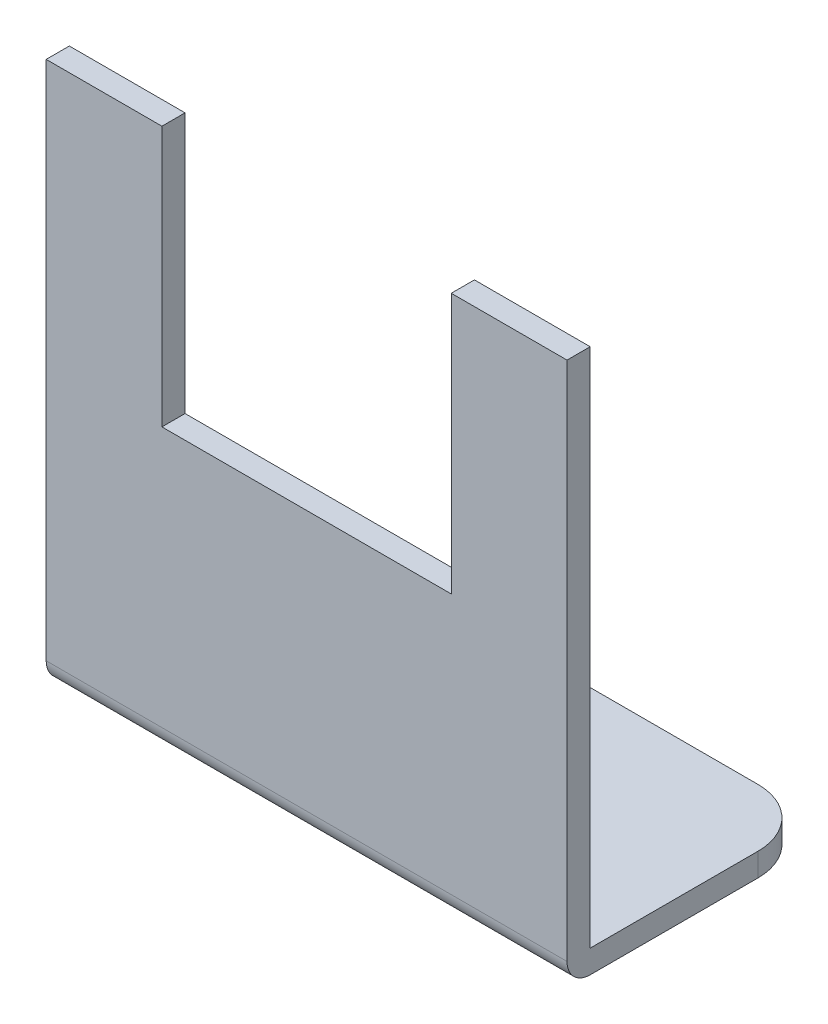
ISO-10303-21;
HEADER;
FILE_DESCRIPTION(('STEP AP214'),'2;1');
FILE_NAME('part.step','',(''),(''),'','','');
FILE_SCHEMA(('AUTOMOTIVE_DESIGN { 1 0 10303 214 1 1 1 1 }'));
ENDSEC;
DATA;
#1=APPLICATION_CONTEXT('core data for automotive mechanical design processes');
#2=APPLICATION_PROTOCOL_DEFINITION('international standard','automotive_design',2000,#1);
#3=PRODUCT_CONTEXT('',#1,'mechanical');
#4=PRODUCT('Part','Part','',(#3));
#5=PRODUCT_RELATED_PRODUCT_CATEGORY('part','',(#4));
#6=PRODUCT_DEFINITION_FORMATION('','',#4);
#7=PRODUCT_DEFINITION_CONTEXT('part definition',#1,'design');
#8=PRODUCT_DEFINITION('design','',#6,#7);
#9=PRODUCT_DEFINITION_SHAPE('','',#8);
#10=(LENGTH_UNIT() NAMED_UNIT(*) SI_UNIT(.MILLI.,.METRE.));
#11=(NAMED_UNIT(*) PLANE_ANGLE_UNIT() SI_UNIT($,.RADIAN.));
#12=(NAMED_UNIT(*) SI_UNIT($,.STERADIAN.) SOLID_ANGLE_UNIT());
#13=UNCERTAINTY_MEASURE_WITH_UNIT(LENGTH_MEASURE(1.E-05),#10,'distance_accuracy_value','');
#14=(GEOMETRIC_REPRESENTATION_CONTEXT(3) GLOBAL_UNCERTAINTY_ASSIGNED_CONTEXT((#13)) GLOBAL_UNIT_ASSIGNED_CONTEXT((#10,
#11,#12)) REPRESENTATION_CONTEXT('',''));
#15=CARTESIAN_POINT('',(0.,0.,0.));
#16=DIRECTION('',(0.,0.,1.));
#17=DIRECTION('',(1.,0.,0.));
#18=AXIS2_PLACEMENT_3D('',#15,#16,#17);
#19=CARTESIAN_POINT('',(0.,0.,0.));
#20=DIRECTION('',(0.,0.,1.));
#21=DIRECTION('',(1.,0.,0.));
#22=AXIS2_PLACEMENT_3D('',#19,#20,#21);
#23=PLANE('',#22);
#24=DIRECTION('',(0.,-1.,0.));
#25=VECTOR('',#24,1.);
#26=CARTESIAN_POINT('',(12.5,0.,0.));
#27=LINE('',#26,#25);
#28=CARTESIAN_POINT('',(12.5,23.5,0.));
#29=VERTEX_POINT('',#28);
#30=CARTESIAN_POINT('',(12.5,0.999999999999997,0.));
#31=VERTEX_POINT('',#30);
#32=EDGE_CURVE('E247',#29,#31,#27,.T.);
#33=ORIENTED_EDGE('',*,*,#32,.F.);
#34=DIRECTION('',(1.,0.,0.));
#35=VECTOR('',#34,1.);
#36=CARTESIAN_POINT('',(-22.5,23.5,0.));
#37=LINE('',#36,#35);
#38=CARTESIAN_POINT('',(22.5,23.5,0.));
#39=VERTEX_POINT('',#38);
#40=EDGE_CURVE('E149',#29,#39,#37,.T.);
#41=ORIENTED_EDGE('',*,*,#40,.T.);
#42=DIRECTION('',(0.,-1.,0.));
#43=VECTOR('',#42,1.);
#44=CARTESIAN_POINT('',(22.5,23.5,0.));
#45=LINE('',#44,#43);
#46=CARTESIAN_POINT('',(22.5,-21.5,0.));
#47=VERTEX_POINT('',#46);
#48=EDGE_CURVE('E168',#39,#47,#45,.T.);
#49=ORIENTED_EDGE('',*,*,#48,.T.);
#50=DIRECTION('',(1.,0.,0.));
#51=VECTOR('',#50,1.);
#52=CARTESIAN_POINT('',(22.5,-21.5,0.));
#53=LINE('',#52,#51);
#54=CARTESIAN_POINT('',(-22.5,-21.5,0.));
#55=VERTEX_POINT('',#54);
#56=EDGE_CURVE('E217',#55,#47,#53,.T.);
#57=ORIENTED_EDGE('',*,*,#56,.F.);
#58=DIRECTION('',(0.,-1.,0.));
#59=VECTOR('',#58,1.);
#60=CARTESIAN_POINT('',(-22.5,23.5,0.));
#61=LINE('',#60,#59);
#62=CARTESIAN_POINT('',(-22.5,23.5,0.));
#63=VERTEX_POINT('',#62);
#64=EDGE_CURVE('E165',#63,#55,#61,.T.);
#65=ORIENTED_EDGE('',*,*,#64,.F.);
#66=CARTESIAN_POINT('',(-12.5,23.5,0.));
#67=VERTEX_POINT('',#66);
#68=EDGE_CURVE('E172',#63,#67,#37,.T.);
#69=ORIENTED_EDGE('',*,*,#68,.T.);
#70=DIRECTION('',(0.,-1.,0.));
#71=VECTOR('',#70,1.);
#72=CARTESIAN_POINT('',(-12.5,0.,0.));
#73=LINE('',#72,#71);
#74=CARTESIAN_POINT('',(-12.5,1.,0.));
#75=VERTEX_POINT('',#74);
#76=EDGE_CURVE('E150',#67,#75,#73,.T.);
#77=ORIENTED_EDGE('',*,*,#76,.T.);
#78=DIRECTION('',(1.,0.,0.));
#79=VECTOR('',#78,1.);
#80=CARTESIAN_POINT('',(0.,0.999999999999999,0.));
#81=LINE('',#80,#79);
#82=EDGE_CURVE('E248',#75,#31,#81,.T.);
#83=ORIENTED_EDGE('',*,*,#82,.T.);
#84=EDGE_LOOP('',(#33,#41,#49,#57,#65,#69,#77,#83));
#85=FACE_BOUND('',#84,.T.);
#86=ADVANCED_FACE('F34',(#85),#23,.F.);
#87=CARTESIAN_POINT('',(-22.5,23.5,2.));
#88=DIRECTION('',(0.,1.,0.));
#89=DIRECTION('',(0.,0.,1.));
#90=AXIS2_PLACEMENT_3D('',#87,#88,#89);
#91=PLANE('',#90);
#92=ORIENTED_EDGE('',*,*,#40,.F.);
#93=DIRECTION('',(0.,0.,1.));
#94=VECTOR('',#93,1.);
#95=CARTESIAN_POINT('',(12.5,23.5,-19.5));
#96=LINE('',#95,#94);
#97=CARTESIAN_POINT('',(12.5,23.5,2.));
#98=VERTEX_POINT('',#97);
#99=EDGE_CURVE('E132',#29,#98,#96,.T.);
#100=ORIENTED_EDGE('',*,*,#99,.T.);
#101=DIRECTION('',(1.,0.,0.));
#102=VECTOR('',#101,1.);
#103=CARTESIAN_POINT('',(-22.5,23.5,2.));
#104=LINE('',#103,#102);
#105=CARTESIAN_POINT('',(22.5,23.5,2.));
#106=VERTEX_POINT('',#105);
#107=EDGE_CURVE('E147',#98,#106,#104,.T.);
#108=ORIENTED_EDGE('',*,*,#107,.T.);
#109=DIRECTION('',(0.,0.,-1.));
#110=VECTOR('',#109,1.);
#111=CARTESIAN_POINT('',(22.5,23.5,2.));
#112=LINE('',#111,#110);
#113=EDGE_CURVE('E176',#106,#39,#112,.T.);
#114=ORIENTED_EDGE('',*,*,#113,.T.);
#115=EDGE_LOOP('',(#92,#100,#108,#114));
#116=FACE_BOUND('',#115,.T.);
#117=ADVANCED_FACE('F145',(#116),#91,.T.);
#118=CARTESIAN_POINT('',(0.,0.,2.));
#119=DIRECTION('',(0.,0.,1.));
#120=DIRECTION('',(1.,0.,0.));
#121=AXIS2_PLACEMENT_3D('',#118,#119,#120);
#122=PLANE('',#121);
#123=ORIENTED_EDGE('',*,*,#107,.F.);
#124=DIRECTION('',(0.,-1.,0.));
#125=VECTOR('',#124,1.);
#126=CARTESIAN_POINT('',(12.5,23.5,2.));
#127=LINE('',#126,#125);
#128=CARTESIAN_POINT('',(12.5,0.999999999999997,2.));
#129=VERTEX_POINT('',#128);
#130=EDGE_CURVE('E129',#98,#129,#127,.T.);
#131=ORIENTED_EDGE('',*,*,#130,.T.);
#132=DIRECTION('',(1.,0.,0.));
#133=VECTOR('',#132,1.);
#134=CARTESIAN_POINT('',(-12.5,1.,2.));
#135=LINE('',#134,#133);
#136=CARTESIAN_POINT('',(-12.5,1.,2.));
#137=VERTEX_POINT('',#136);
#138=EDGE_CURVE('E140',#137,#129,#135,.T.);
#139=ORIENTED_EDGE('',*,*,#138,.F.);
#140=DIRECTION('',(0.,-1.,0.));
#141=VECTOR('',#140,1.);
#142=CARTESIAN_POINT('',(-12.5,23.5,2.));
#143=LINE('',#142,#141);
#144=CARTESIAN_POINT('',(-12.5,23.5,2.));
#145=VERTEX_POINT('',#144);
#146=EDGE_CURVE('E260',#145,#137,#143,.T.);
#147=ORIENTED_EDGE('',*,*,#146,.F.);
#148=CARTESIAN_POINT('',(-22.5,23.5,2.));
#149=VERTEX_POINT('',#148);
#150=EDGE_CURVE('E157',#149,#145,#104,.T.);
#151=ORIENTED_EDGE('',*,*,#150,.F.);
#152=DIRECTION('',(0.,-1.,0.));
#153=VECTOR('',#152,1.);
#154=CARTESIAN_POINT('',(-22.5,23.5,2.));
#155=LINE('',#154,#153);
#156=CARTESIAN_POINT('',(-22.5,-21.5,2.));
#157=VERTEX_POINT('',#156);
#158=EDGE_CURVE('E161',#149,#157,#155,.T.);
#159=ORIENTED_EDGE('',*,*,#158,.T.);
#160=DIRECTION('',(1.,0.,0.));
#161=VECTOR('',#160,1.);
#162=CARTESIAN_POINT('',(22.5,-21.5,2.));
#163=LINE('',#162,#161);
#164=CARTESIAN_POINT('',(22.5,-21.5,2.));
#165=VERTEX_POINT('',#164);
#166=EDGE_CURVE('E183',#157,#165,#163,.T.);
#167=ORIENTED_EDGE('',*,*,#166,.T.);
#168=DIRECTION('',(0.,-1.,0.));
#169=VECTOR('',#168,1.);
#170=CARTESIAN_POINT('',(22.5,23.5,2.));
#171=LINE('',#170,#169);
#172=EDGE_CURVE('E156',#106,#165,#171,.T.);
#173=ORIENTED_EDGE('',*,*,#172,.F.);
#174=EDGE_LOOP('',(#123,#131,#139,#147,#151,#159,#167,#173));
#175=FACE_BOUND('',#174,.T.);
#176=ADVANCED_FACE('F153',(#175),#122,.T.);
#177=CARTESIAN_POINT('',(-22.5,23.5,2.));
#178=DIRECTION('',(1.,0.,0.));
#179=DIRECTION('',(0.,1.,0.));
#180=AXIS2_PLACEMENT_3D('',#177,#178,#179);
#181=PLANE('',#180);
#182=DIRECTION('',(0.,0.,1.));
#183=VECTOR('',#182,1.);
#184=CARTESIAN_POINT('',(-22.5,-21.5,-19.5));
#185=LINE('',#184,#183);
#186=CARTESIAN_POINT('',(-22.5,-21.5,-14.5));
#187=VERTEX_POINT('',#186);
#188=EDGE_CURVE('E169',#187,#55,#185,.T.);
#189=ORIENTED_EDGE('',*,*,#188,.F.);
#190=DIRECTION('',(0.,1.,0.));
#191=VECTOR('',#190,1.);
#192=CARTESIAN_POINT('',(-22.5,23.5,-14.5));
#193=LINE('',#192,#191);
#194=CARTESIAN_POINT('',(-22.5,-23.5,-14.5));
#195=VERTEX_POINT('',#194);
#196=EDGE_CURVE('E201',#187,#195,#193,.F.);
#197=ORIENTED_EDGE('',*,*,#196,.T.);
#198=DIRECTION('',(0.,0.,-1.));
#199=VECTOR('',#198,1.);
#200=CARTESIAN_POINT('',(-22.5,-23.5,2.));
#201=LINE('',#200,#199);
#202=CARTESIAN_POINT('',(-22.5,-23.5,0.));
#203=VERTEX_POINT('',#202);
#204=EDGE_CURVE('E180',#203,#195,#201,.T.);
#205=ORIENTED_EDGE('',*,*,#204,.F.);
#206=CARTESIAN_POINT('',(-22.5,-21.5,0.));
#207=DIRECTION('',(1.,0.,0.));
#208=DIRECTION('',(0.,1.,0.));
#209=AXIS2_PLACEMENT_3D('',#206,#207,#208);
#210=CIRCLE('',#209,2.);
#211=EDGE_CURVE('E189',#203,#157,#210,.F.);
#212=ORIENTED_EDGE('',*,*,#211,.T.);
#213=ORIENTED_EDGE('',*,*,#158,.F.);
#214=DIRECTION('',(0.,0.,-1.));
#215=VECTOR('',#214,1.);
#216=CARTESIAN_POINT('',(-22.5,23.5,2.));
#217=LINE('',#216,#215);
#218=EDGE_CURVE('E160',#149,#63,#217,.T.);
#219=ORIENTED_EDGE('',*,*,#218,.T.);
#220=ORIENTED_EDGE('',*,*,#64,.T.);
#221=EDGE_LOOP('',(#189,#197,#205,#212,#213,#219,#220));
#222=FACE_BOUND('',#221,.T.);
#223=ADVANCED_FACE('F226',(#222),#181,.F.);
#224=CARTESIAN_POINT('',(-22.5,-23.5,2.));
#225=DIRECTION('',(0.,1.,0.));
#226=DIRECTION('',(0.,0.,1.));
#227=AXIS2_PLACEMENT_3D('',#224,#225,#226);
#228=PLANE('',#227);
#229=CARTESIAN_POINT('',(0.,-23.5,-14.5));
#230=DIRECTION('',(0.,1.,0.));
#231=DIRECTION('',(-1.,0.,0.));
#232=AXIS2_PLACEMENT_3D('',#229,#230,#231);
#233=CIRCLE('',#232,1.5);
#234=CARTESIAN_POINT('',(-1.5,-23.5,-14.5));
#235=VERTEX_POINT('',#234);
#236=EDGE_CURVE('E141',#235,#235,#233,.T.);
#237=ORIENTED_EDGE('',*,*,#236,.T.);
#238=EDGE_LOOP('',(#237));
#239=FACE_BOUND('',#238,.T.);
#240=ORIENTED_EDGE('',*,*,#204,.T.);
#241=CARTESIAN_POINT('',(-17.5,-23.5,-14.5));
#242=DIRECTION('',(0.,1.,0.));
#243=DIRECTION('',(0.,0.,1.));
#244=AXIS2_PLACEMENT_3D('',#241,#242,#243);
#245=CIRCLE('',#244,5.);
#246=CARTESIAN_POINT('',(-17.5,-23.5,-19.5));
#247=VERTEX_POINT('',#246);
#248=EDGE_CURVE('E42',#195,#247,#245,.F.);
#249=ORIENTED_EDGE('',*,*,#248,.T.);
#250=DIRECTION('',(-1.,0.,0.));
#251=VECTOR('',#250,1.);
#252=CARTESIAN_POINT('',(22.5,-23.5,-19.5));
#253=LINE('',#252,#251);
#254=CARTESIAN_POINT('',(17.5,-23.5,-19.5));
#255=VERTEX_POINT('',#254);
#256=EDGE_CURVE('E206',#255,#247,#253,.T.);
#257=ORIENTED_EDGE('',*,*,#256,.F.);
#258=CARTESIAN_POINT('',(17.5,-23.5,-14.5));
#259=DIRECTION('',(0.,1.,0.));
#260=DIRECTION('',(0.,0.,1.));
#261=AXIS2_PLACEMENT_3D('',#258,#259,#260);
#262=CIRCLE('',#261,5.);
#263=CARTESIAN_POINT('',(22.5,-23.5,-14.5));
#264=VERTEX_POINT('',#263);
#265=EDGE_CURVE('E57',#255,#264,#262,.F.);
#266=ORIENTED_EDGE('',*,*,#265,.T.);
#267=DIRECTION('',(0.,0.,-1.));
#268=VECTOR('',#267,1.);
#269=CARTESIAN_POINT('',(22.5,-23.5,2.));
#270=LINE('',#269,#268);
#271=CARTESIAN_POINT('',(22.5,-23.5,0.));
#272=VERTEX_POINT('',#271);
#273=EDGE_CURVE('E178',#272,#264,#270,.T.);
#274=ORIENTED_EDGE('',*,*,#273,.F.);
#275=DIRECTION('',(1.,0.,0.));
#276=VECTOR('',#275,1.);
#277=CARTESIAN_POINT('',(-22.5,-23.5,0.));
#278=LINE('',#277,#276);
#279=EDGE_CURVE('E187',#272,#203,#278,.F.);
#280=ORIENTED_EDGE('',*,*,#279,.T.);
#281=EDGE_LOOP('',(#240,#249,#257,#266,#274,#280));
#282=FACE_BOUND('',#281,.T.);
#283=ADVANCED_FACE('F205',(#239,#282),#228,.F.);
#284=CARTESIAN_POINT('',(22.5,23.5,2.));
#285=DIRECTION('',(1.,0.,0.));
#286=DIRECTION('',(0.,1.,0.));
#287=AXIS2_PLACEMENT_3D('',#284,#285,#286);
#288=PLANE('',#287);
#289=ORIENTED_EDGE('',*,*,#273,.T.);
#290=DIRECTION('',(0.,-1.,0.));
#291=VECTOR('',#290,1.);
#292=CARTESIAN_POINT('',(22.5,-21.5,-14.5));
#293=LINE('',#292,#291);
#294=CARTESIAN_POINT('',(22.5,-21.5,-14.5));
#295=VERTEX_POINT('',#294);
#296=EDGE_CURVE('E11',#264,#295,#293,.F.);
#297=ORIENTED_EDGE('',*,*,#296,.T.);
#298=DIRECTION('',(0.,0.,1.));
#299=VECTOR('',#298,1.);
#300=CARTESIAN_POINT('',(22.5,-21.5,-19.5));
#301=LINE('',#300,#299);
#302=EDGE_CURVE('E228',#295,#47,#301,.T.);
#303=ORIENTED_EDGE('',*,*,#302,.T.);
#304=ORIENTED_EDGE('',*,*,#48,.F.);
#305=ORIENTED_EDGE('',*,*,#113,.F.);
#306=ORIENTED_EDGE('',*,*,#172,.T.);
#307=CARTESIAN_POINT('',(22.5,-21.5,0.));
#308=DIRECTION('',(1.,0.,0.));
#309=DIRECTION('',(0.,1.,0.));
#310=AXIS2_PLACEMENT_3D('',#307,#308,#309);
#311=CIRCLE('',#310,2.);
#312=EDGE_CURVE('E185',#165,#272,#311,.T.);
#313=ORIENTED_EDGE('',*,*,#312,.T.);
#314=EDGE_LOOP('',(#289,#297,#303,#304,#305,#306,#313));
#315=FACE_BOUND('',#314,.T.);
#316=ADVANCED_FACE('F241',(#315),#288,.T.);
#317=DIRECTION('',(0.,0.,1.));
#318=VECTOR('',#317,1.);
#319=CARTESIAN_POINT('',(-12.5,23.5,-19.5));
#320=LINE('',#319,#318);
#321=EDGE_CURVE('E49',#67,#145,#320,.T.);
#322=ORIENTED_EDGE('',*,*,#321,.F.);
#323=ORIENTED_EDGE('',*,*,#68,.F.);
#324=ORIENTED_EDGE('',*,*,#218,.F.);
#325=ORIENTED_EDGE('',*,*,#150,.T.);
#326=EDGE_LOOP('',(#322,#323,#324,#325));
#327=FACE_BOUND('',#326,.T.);
#328=ADVANCED_FACE('F278',(#327),#91,.T.);
#329=CARTESIAN_POINT('',(22.5,-21.5,-19.5));
#330=DIRECTION('',(0.,-1.,0.));
#331=DIRECTION('',(1.,0.,0.));
#332=AXIS2_PLACEMENT_3D('',#329,#330,#331);
#333=PLANE('',#332);
#334=CARTESIAN_POINT('',(0.,-21.5,-14.5));
#335=DIRECTION('',(0.,1.,0.));
#336=DIRECTION('',(-1.,0.,0.));
#337=AXIS2_PLACEMENT_3D('',#334,#335,#336);
#338=CIRCLE('',#337,1.5);
#339=CARTESIAN_POINT('',(-1.5,-21.5,-14.5));
#340=VERTEX_POINT('',#339);
#341=EDGE_CURVE('E263',#340,#340,#338,.T.);
#342=ORIENTED_EDGE('',*,*,#341,.F.);
#343=EDGE_LOOP('',(#342));
#344=FACE_BOUND('',#343,.T.);
#345=DIRECTION('',(1.,0.,0.));
#346=VECTOR('',#345,1.);
#347=CARTESIAN_POINT('',(22.5,-21.5,-19.5));
#348=LINE('',#347,#346);
#349=CARTESIAN_POINT('',(-17.5,-21.5,-19.5));
#350=VERTEX_POINT('',#349);
#351=CARTESIAN_POINT('',(17.5,-21.5,-19.5));
#352=VERTEX_POINT('',#351);
#353=EDGE_CURVE('E216',#350,#352,#348,.T.);
#354=ORIENTED_EDGE('',*,*,#353,.F.);
#355=CARTESIAN_POINT('',(-17.5,-21.5,-14.5));
#356=DIRECTION('',(0.,-1.,0.));
#357=DIRECTION('',(1.,0.,0.));
#358=AXIS2_PLACEMENT_3D('',#355,#356,#357);
#359=CIRCLE('',#358,5.);
#360=EDGE_CURVE('E199',#350,#187,#359,.F.);
#361=ORIENTED_EDGE('',*,*,#360,.T.);
#362=ORIENTED_EDGE('',*,*,#188,.T.);
#363=ORIENTED_EDGE('',*,*,#56,.T.);
#364=ORIENTED_EDGE('',*,*,#302,.F.);
#365=CARTESIAN_POINT('',(17.5,-21.5,-14.5));
#366=DIRECTION('',(0.,-1.,0.));
#367=DIRECTION('',(1.,0.,0.));
#368=AXIS2_PLACEMENT_3D('',#365,#366,#367);
#369=CIRCLE('',#368,5.);
#370=EDGE_CURVE('E197',#295,#352,#369,.F.);
#371=ORIENTED_EDGE('',*,*,#370,.T.);
#372=EDGE_LOOP('',(#354,#361,#362,#363,#364,#371));
#373=FACE_BOUND('',#372,.T.);
#374=ADVANCED_FACE('F222',(#344,#373),#333,.F.);
#375=CARTESIAN_POINT('',(0.,0.,-19.5));
#376=DIRECTION('',(0.,0.,1.));
#377=DIRECTION('',(1.,0.,0.));
#378=AXIS2_PLACEMENT_3D('',#375,#376,#377);
#379=PLANE('',#378);
#380=ORIENTED_EDGE('',*,*,#256,.T.);
#381=DIRECTION('',(0.,1.,0.));
#382=VECTOR('',#381,1.);
#383=CARTESIAN_POINT('',(-17.5,0.,-19.5));
#384=LINE('',#383,#382);
#385=EDGE_CURVE('E194',#247,#350,#384,.T.);
#386=ORIENTED_EDGE('',*,*,#385,.T.);
#387=ORIENTED_EDGE('',*,*,#353,.T.);
#388=DIRECTION('',(0.,-1.,0.));
#389=VECTOR('',#388,1.);
#390=CARTESIAN_POINT('',(17.5,-23.5,-19.5));
#391=LINE('',#390,#389);
#392=EDGE_CURVE('E191',#352,#255,#391,.T.);
#393=ORIENTED_EDGE('',*,*,#392,.T.);
#394=EDGE_LOOP('',(#380,#386,#387,#393));
#395=FACE_BOUND('',#394,.T.);
#396=ADVANCED_FACE('F212',(#395),#379,.F.);
#397=CARTESIAN_POINT('',(0.,-21.5,0.));
#398=DIRECTION('',(-1.,0.,0.));
#399=DIRECTION('',(0.,0.,1.));
#400=AXIS2_PLACEMENT_3D('',#397,#398,#399);
#401=CYLINDRICAL_SURFACE('',#400,2.);
#402=ORIENTED_EDGE('',*,*,#211,.F.);
#403=ORIENTED_EDGE('',*,*,#279,.F.);
#404=ORIENTED_EDGE('',*,*,#312,.F.);
#405=ORIENTED_EDGE('',*,*,#166,.F.);
#406=EDGE_LOOP('',(#402,#403,#404,#405));
#407=FACE_BOUND('',#406,.T.);
#408=ADVANCED_FACE('F238',(#407),#401,.T.);
#409=CARTESIAN_POINT('',(-17.5,0.,-14.5));
#410=DIRECTION('',(0.,1.,0.));
#411=DIRECTION('',(-1.,0.,0.));
#412=AXIS2_PLACEMENT_3D('',#409,#410,#411);
#413=CYLINDRICAL_SURFACE('',#412,5.);
#414=ORIENTED_EDGE('',*,*,#248,.F.);
#415=ORIENTED_EDGE('',*,*,#196,.F.);
#416=ORIENTED_EDGE('',*,*,#360,.F.);
#417=ORIENTED_EDGE('',*,*,#385,.F.);
#418=EDGE_LOOP('',(#414,#415,#416,#417));
#419=FACE_BOUND('',#418,.T.);
#420=ADVANCED_FACE('F219',(#419),#413,.T.);
#421=CARTESIAN_POINT('',(17.5,0.,-14.5));
#422=DIRECTION('',(0.,1.,0.));
#423=DIRECTION('',(-1.,0.,0.));
#424=AXIS2_PLACEMENT_3D('',#421,#422,#423);
#425=CYLINDRICAL_SURFACE('',#424,5.);
#426=ORIENTED_EDGE('',*,*,#370,.F.);
#427=ORIENTED_EDGE('',*,*,#296,.F.);
#428=ORIENTED_EDGE('',*,*,#265,.F.);
#429=ORIENTED_EDGE('',*,*,#392,.F.);
#430=EDGE_LOOP('',(#426,#427,#428,#429));
#431=FACE_BOUND('',#430,.T.);
#432=ADVANCED_FACE('F36',(#431),#425,.T.);
#433=CARTESIAN_POINT('',(12.5,23.5,-19.5));
#434=DIRECTION('',(-1.,0.,0.));
#435=DIRECTION('',(0.,-1.,0.));
#436=AXIS2_PLACEMENT_3D('',#433,#434,#435);
#437=PLANE('',#436);
#438=ORIENTED_EDGE('',*,*,#32,.T.);
#439=DIRECTION('',(0.,0.,1.));
#440=VECTOR('',#439,1.);
#441=CARTESIAN_POINT('',(12.5,0.999999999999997,-19.5));
#442=LINE('',#441,#440);
#443=EDGE_CURVE('E135',#31,#129,#442,.T.);
#444=ORIENTED_EDGE('',*,*,#443,.T.);
#445=ORIENTED_EDGE('',*,*,#130,.F.);
#446=ORIENTED_EDGE('',*,*,#99,.F.);
#447=EDGE_LOOP('',(#438,#444,#445,#446));
#448=FACE_BOUND('',#447,.T.);
#449=ADVANCED_FACE('F131',(#448),#437,.T.);
#450=CARTESIAN_POINT('',(-12.5,1.,-19.5));
#451=DIRECTION('',(0.,-1.,0.));
#452=DIRECTION('',(1.,0.,0.));
#453=AXIS2_PLACEMENT_3D('',#450,#451,#452);
#454=PLANE('',#453);
#455=DIRECTION('',(0.,0.,1.));
#456=VECTOR('',#455,1.);
#457=CARTESIAN_POINT('',(-12.5,1.,-19.5));
#458=LINE('',#457,#456);
#459=EDGE_CURVE('E257',#75,#137,#458,.T.);
#460=ORIENTED_EDGE('',*,*,#459,.T.);
#461=ORIENTED_EDGE('',*,*,#138,.T.);
#462=ORIENTED_EDGE('',*,*,#443,.F.);
#463=ORIENTED_EDGE('',*,*,#82,.F.);
#464=EDGE_LOOP('',(#460,#461,#462,#463));
#465=FACE_BOUND('',#464,.T.);
#466=ADVANCED_FACE('F309',(#465),#454,.F.);
#467=CARTESIAN_POINT('',(-12.5,23.5,-19.5));
#468=DIRECTION('',(-1.,0.,0.));
#469=DIRECTION('',(0.,-1.,0.));
#470=AXIS2_PLACEMENT_3D('',#467,#468,#469);
#471=PLANE('',#470);
#472=ORIENTED_EDGE('',*,*,#321,.T.);
#473=ORIENTED_EDGE('',*,*,#146,.T.);
#474=ORIENTED_EDGE('',*,*,#459,.F.);
#475=ORIENTED_EDGE('',*,*,#76,.F.);
#476=EDGE_LOOP('',(#472,#473,#474,#475));
#477=FACE_BOUND('',#476,.T.);
#478=ADVANCED_FACE('F273',(#477),#471,.F.);
#479=CARTESIAN_POINT('',(0.,-23.5,-14.5));
#480=DIRECTION('',(0.,1.,0.));
#481=DIRECTION('',(-1.,0.,0.));
#482=AXIS2_PLACEMENT_3D('',#479,#480,#481);
#483=CYLINDRICAL_SURFACE('',#482,1.5);
#484=ORIENTED_EDGE('',*,*,#236,.F.);
#485=EDGE_LOOP('',(#484));
#486=FACE_BOUND('',#485,.T.);
#487=ORIENTED_EDGE('',*,*,#341,.T.);
#488=EDGE_LOOP('',(#487));
#489=FACE_BOUND('',#488,.T.);
#490=ADVANCED_FACE('F270',(#486,#489),#483,.F.);
#491=CLOSED_SHELL('',(#86,#117,#176,#223,#283,#316,#328,#374,#396,#408,#420,#432,#449,#466,#478,#490));
#492=MANIFOLD_SOLID_BREP('B2',#491);
#493=ADVANCED_BREP_SHAPE_REPRESENTATION('',(#18,#492),#14);
#494=SHAPE_DEFINITION_REPRESENTATION(#9,#493);
ENDSEC;
END-ISO-10303-21;
